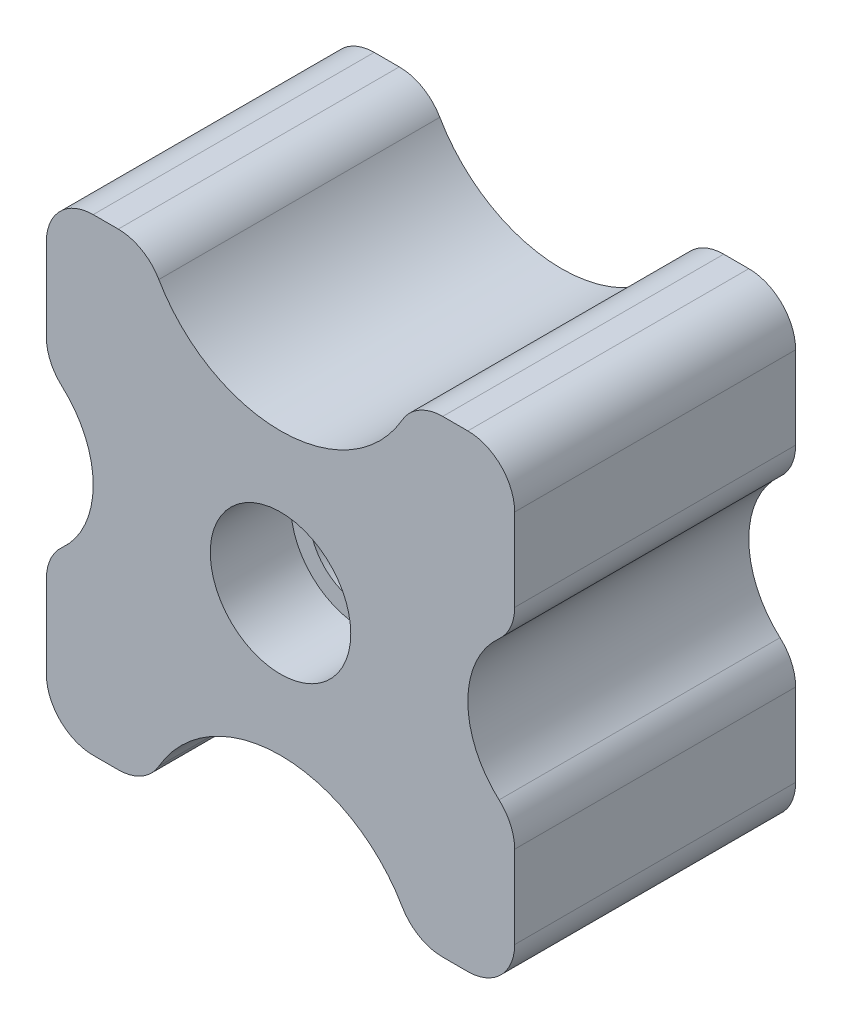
ISO-10303-21;
HEADER;
FILE_DESCRIPTION(('STEP AP214'),'2;1');
FILE_NAME('part.step','',(''),(''),'','','');
FILE_SCHEMA(('AUTOMOTIVE_DESIGN { 1 0 10303 214 1 1 1 1 }'));
ENDSEC;
DATA;
#1=APPLICATION_CONTEXT('core data for automotive mechanical design processes');
#2=APPLICATION_PROTOCOL_DEFINITION('international standard','automotive_design',2000,#1);
#3=PRODUCT_CONTEXT('',#1,'mechanical');
#4=PRODUCT('Part','Part','',(#3));
#5=PRODUCT_RELATED_PRODUCT_CATEGORY('part','',(#4));
#6=PRODUCT_DEFINITION_FORMATION('','',#4);
#7=PRODUCT_DEFINITION_CONTEXT('part definition',#1,'design');
#8=PRODUCT_DEFINITION('design','',#6,#7);
#9=PRODUCT_DEFINITION_SHAPE('','',#8);
#10=(LENGTH_UNIT() NAMED_UNIT(*) SI_UNIT(.MILLI.,.METRE.));
#11=(NAMED_UNIT(*) PLANE_ANGLE_UNIT() SI_UNIT($,.RADIAN.));
#12=(NAMED_UNIT(*) SI_UNIT($,.STERADIAN.) SOLID_ANGLE_UNIT());
#13=UNCERTAINTY_MEASURE_WITH_UNIT(LENGTH_MEASURE(1.E-05),#10,'distance_accuracy_value','');
#14=(GEOMETRIC_REPRESENTATION_CONTEXT(3) GLOBAL_UNCERTAINTY_ASSIGNED_CONTEXT((#13)) GLOBAL_UNIT_ASSIGNED_CONTEXT((#10,
#11,#12)) REPRESENTATION_CONTEXT('',''));
#15=CARTESIAN_POINT('',(0.,0.,0.));
#16=DIRECTION('',(0.,0.,1.));
#17=DIRECTION('',(1.,0.,0.));
#18=AXIS2_PLACEMENT_3D('',#15,#16,#17);
#19=CARTESIAN_POINT('',(-25.,25.,30.));
#20=DIRECTION('',(0.,-1.,0.));
#21=DIRECTION('',(0.,0.,-1.));
#22=AXIS2_PLACEMENT_3D('',#19,#20,#21);
#23=PLANE('',#22);
#24=DIRECTION('',(-1.,0.,0.));
#25=VECTOR('',#24,1.);
#26=CARTESIAN_POINT('',(-25.,25.,30.));
#27=LINE('',#26,#25);
#28=CARTESIAN_POINT('',(-17.3205080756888,25.,30.));
#29=VERTEX_POINT('',#28);
#30=CARTESIAN_POINT('',(-20.,25.,30.));
#31=VERTEX_POINT('',#30);
#32=EDGE_CURVE('E400',#29,#31,#27,.T.);
#33=ORIENTED_EDGE('',*,*,#32,.F.);
#34=DIRECTION('',(0.,0.,1.));
#35=VECTOR('',#34,1.);
#36=CARTESIAN_POINT('',(-17.3205080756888,25.,0.));
#37=LINE('',#36,#35);
#38=CARTESIAN_POINT('',(-17.3205080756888,25.,0.));
#39=VERTEX_POINT('',#38);
#40=EDGE_CURVE('E211',#29,#39,#37,.F.);
#41=ORIENTED_EDGE('',*,*,#40,.T.);
#42=DIRECTION('',(-1.,0.,0.));
#43=VECTOR('',#42,1.);
#44=CARTESIAN_POINT('',(-25.,25.,0.));
#45=LINE('',#44,#43);
#46=CARTESIAN_POINT('',(-20.,25.,0.));
#47=VERTEX_POINT('',#46);
#48=EDGE_CURVE('E326',#39,#47,#45,.T.);
#49=ORIENTED_EDGE('',*,*,#48,.T.);
#50=DIRECTION('',(0.,0.,-1.));
#51=VECTOR('',#50,1.);
#52=CARTESIAN_POINT('',(-20.,25.,30.));
#53=LINE('',#52,#51);
#54=EDGE_CURVE('E265',#47,#31,#53,.F.);
#55=ORIENTED_EDGE('',*,*,#54,.T.);
#56=EDGE_LOOP('',(#33,#41,#49,#55));
#57=FACE_BOUND('',#56,.T.);
#58=ADVANCED_FACE('F45',(#57),#23,.F.);
#59=CARTESIAN_POINT('',(20.,25.,0.));
#60=VERTEX_POINT('',#59);
#61=CARTESIAN_POINT('',(17.3205080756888,25.,0.));
#62=VERTEX_POINT('',#61);
#63=EDGE_CURVE('E330',#60,#62,#45,.T.);
#64=ORIENTED_EDGE('',*,*,#63,.T.);
#65=DIRECTION('',(0.,0.,1.));
#66=VECTOR('',#65,1.);
#67=CARTESIAN_POINT('',(17.3205080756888,25.,30.));
#68=LINE('',#67,#66);
#69=CARTESIAN_POINT('',(17.3205080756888,25.,30.));
#70=VERTEX_POINT('',#69);
#71=EDGE_CURVE('E379',#62,#70,#68,.T.);
#72=ORIENTED_EDGE('',*,*,#71,.T.);
#73=CARTESIAN_POINT('',(20.,25.,30.));
#74=VERTEX_POINT('',#73);
#75=EDGE_CURVE('E461',#74,#70,#27,.T.);
#76=ORIENTED_EDGE('',*,*,#75,.F.);
#77=DIRECTION('',(0.,0.,-1.));
#78=VECTOR('',#77,1.);
#79=CARTESIAN_POINT('',(20.,25.,30.));
#80=LINE('',#79,#78);
#81=EDGE_CURVE('E376',#74,#60,#80,.T.);
#82=ORIENTED_EDGE('',*,*,#81,.T.);
#83=EDGE_LOOP('',(#64,#72,#76,#82));
#84=FACE_BOUND('',#83,.T.);
#85=ADVANCED_FACE('F517',(#84),#23,.F.);
#86=CARTESIAN_POINT('',(25.,25.,30.));
#87=DIRECTION('',(-1.,0.,0.));
#88=DIRECTION('',(0.,-1.,0.));
#89=AXIS2_PLACEMENT_3D('',#86,#87,#88);
#90=PLANE('',#89);
#91=DIRECTION('',(0.,1.,0.));
#92=VECTOR('',#91,1.);
#93=CARTESIAN_POINT('',(25.,25.,0.));
#94=LINE('',#93,#92);
#95=CARTESIAN_POINT('',(25.,11.180339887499,0.));
#96=VERTEX_POINT('',#95);
#97=CARTESIAN_POINT('',(25.,20.,0.));
#98=VERTEX_POINT('',#97);
#99=EDGE_CURVE('E327',#96,#98,#94,.T.);
#100=ORIENTED_EDGE('',*,*,#99,.T.);
#101=DIRECTION('',(0.,0.,-1.));
#102=VECTOR('',#101,1.);
#103=CARTESIAN_POINT('',(25.,20.,30.));
#104=LINE('',#103,#102);
#105=CARTESIAN_POINT('',(25.,20.,30.));
#106=VERTEX_POINT('',#105);
#107=EDGE_CURVE('E60',#98,#106,#104,.F.);
#108=ORIENTED_EDGE('',*,*,#107,.T.);
#109=DIRECTION('',(0.,1.,0.));
#110=VECTOR('',#109,1.);
#111=CARTESIAN_POINT('',(25.,25.,30.));
#112=LINE('',#111,#110);
#113=CARTESIAN_POINT('',(25.,11.180339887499,30.));
#114=VERTEX_POINT('',#113);
#115=EDGE_CURVE('E346',#114,#106,#112,.T.);
#116=ORIENTED_EDGE('',*,*,#115,.F.);
#117=DIRECTION('',(0.,0.,1.));
#118=VECTOR('',#117,1.);
#119=CARTESIAN_POINT('',(25.,11.180339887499,0.));
#120=LINE('',#119,#118);
#121=EDGE_CURVE('E298',#114,#96,#120,.F.);
#122=ORIENTED_EDGE('',*,*,#121,.T.);
#123=EDGE_LOOP('',(#100,#108,#116,#122));
#124=FACE_BOUND('',#123,.T.);
#125=ADVANCED_FACE('F523',(#124),#90,.F.);
#126=CARTESIAN_POINT('',(25.,-20.,0.));
#127=VERTEX_POINT('',#126);
#128=CARTESIAN_POINT('',(25.,-11.180339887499,0.));
#129=VERTEX_POINT('',#128);
#130=EDGE_CURVE('E313',#127,#129,#94,.T.);
#131=ORIENTED_EDGE('',*,*,#130,.T.);
#132=DIRECTION('',(0.,0.,1.));
#133=VECTOR('',#132,1.);
#134=CARTESIAN_POINT('',(25.,-11.180339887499,30.));
#135=LINE('',#134,#133);
#136=CARTESIAN_POINT('',(25.,-11.180339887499,30.));
#137=VERTEX_POINT('',#136);
#138=EDGE_CURVE('E12',#129,#137,#135,.T.);
#139=ORIENTED_EDGE('',*,*,#138,.T.);
#140=CARTESIAN_POINT('',(25.,-20.,30.));
#141=VERTEX_POINT('',#140);
#142=EDGE_CURVE('E316',#141,#137,#112,.T.);
#143=ORIENTED_EDGE('',*,*,#142,.F.);
#144=DIRECTION('',(0.,0.,-1.));
#145=VECTOR('',#144,1.);
#146=CARTESIAN_POINT('',(25.,-20.,30.));
#147=LINE('',#146,#145);
#148=EDGE_CURVE('E53',#141,#127,#147,.T.);
#149=ORIENTED_EDGE('',*,*,#148,.T.);
#150=EDGE_LOOP('',(#131,#139,#143,#149));
#151=FACE_BOUND('',#150,.T.);
#152=ADVANCED_FACE('F312',(#151),#90,.F.);
#153=CARTESIAN_POINT('',(-25.,-25.,30.));
#154=DIRECTION('',(0.,1.,0.));
#155=DIRECTION('',(0.,0.,1.));
#156=AXIS2_PLACEMENT_3D('',#153,#154,#155);
#157=PLANE('',#156);
#158=DIRECTION('',(1.,0.,0.));
#159=VECTOR('',#158,1.);
#160=CARTESIAN_POINT('',(-25.,-25.,30.));
#161=LINE('',#160,#159);
#162=CARTESIAN_POINT('',(17.3205080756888,-25.,30.));
#163=VERTEX_POINT('',#162);
#164=CARTESIAN_POINT('',(20.,-25.,30.));
#165=VERTEX_POINT('',#164);
#166=EDGE_CURVE('E334',#163,#165,#161,.T.);
#167=ORIENTED_EDGE('',*,*,#166,.F.);
#168=DIRECTION('',(0.,0.,1.));
#169=VECTOR('',#168,1.);
#170=CARTESIAN_POINT('',(17.3205080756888,-25.,0.));
#171=LINE('',#170,#169);
#172=CARTESIAN_POINT('',(17.3205080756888,-25.,0.));
#173=VERTEX_POINT('',#172);
#174=EDGE_CURVE('E296',#163,#173,#171,.F.);
#175=ORIENTED_EDGE('',*,*,#174,.T.);
#176=DIRECTION('',(1.,0.,0.));
#177=VECTOR('',#176,1.);
#178=CARTESIAN_POINT('',(-25.,-25.,0.));
#179=LINE('',#178,#177);
#180=CARTESIAN_POINT('',(20.,-25.,0.));
#181=VERTEX_POINT('',#180);
#182=EDGE_CURVE('E341',#173,#181,#179,.T.);
#183=ORIENTED_EDGE('',*,*,#182,.T.);
#184=DIRECTION('',(0.,0.,-1.));
#185=VECTOR('',#184,1.);
#186=CARTESIAN_POINT('',(20.,-25.,30.));
#187=LINE('',#186,#185);
#188=EDGE_CURVE('E294',#181,#165,#187,.F.);
#189=ORIENTED_EDGE('',*,*,#188,.T.);
#190=EDGE_LOOP('',(#167,#175,#183,#189));
#191=FACE_BOUND('',#190,.T.);
#192=ADVANCED_FACE('F442',(#191),#157,.F.);
#193=CARTESIAN_POINT('',(-20.,-25.,30.));
#194=VERTEX_POINT('',#193);
#195=CARTESIAN_POINT('',(-17.3205080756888,-25.,30.));
#196=VERTEX_POINT('',#195);
#197=EDGE_CURVE('E350',#194,#196,#161,.T.);
#198=ORIENTED_EDGE('',*,*,#197,.F.);
#199=DIRECTION('',(0.,0.,-1.));
#200=VECTOR('',#199,1.);
#201=CARTESIAN_POINT('',(-20.,-25.,30.));
#202=LINE('',#201,#200);
#203=CARTESIAN_POINT('',(-20.,-25.,0.));
#204=VERTEX_POINT('',#203);
#205=EDGE_CURVE('E285',#194,#204,#202,.T.);
#206=ORIENTED_EDGE('',*,*,#205,.T.);
#207=CARTESIAN_POINT('',(-17.3205080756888,-25.,0.));
#208=VERTEX_POINT('',#207);
#209=EDGE_CURVE('E343',#204,#208,#179,.T.);
#210=ORIENTED_EDGE('',*,*,#209,.T.);
#211=DIRECTION('',(0.,0.,1.));
#212=VECTOR('',#211,1.);
#213=CARTESIAN_POINT('',(-17.3205080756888,-25.,30.));
#214=LINE('',#213,#212);
#215=EDGE_CURVE('E283',#208,#196,#214,.T.);
#216=ORIENTED_EDGE('',*,*,#215,.T.);
#217=EDGE_LOOP('',(#198,#206,#210,#216));
#218=FACE_BOUND('',#217,.T.);
#219=ADVANCED_FACE('F491',(#218),#157,.F.);
#220=CARTESIAN_POINT('',(-25.,25.,30.));
#221=DIRECTION('',(1.,0.,0.));
#222=DIRECTION('',(0.,0.,-1.));
#223=AXIS2_PLACEMENT_3D('',#220,#221,#222);
#224=PLANE('',#223);
#225=DIRECTION('',(0.,-1.,0.));
#226=VECTOR('',#225,1.);
#227=CARTESIAN_POINT('',(-25.,25.,30.));
#228=LINE('',#227,#226);
#229=CARTESIAN_POINT('',(-25.,-11.180339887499,30.));
#230=VERTEX_POINT('',#229);
#231=CARTESIAN_POINT('',(-25.,-20.,30.));
#232=VERTEX_POINT('',#231);
#233=EDGE_CURVE('E452',#230,#232,#228,.T.);
#234=ORIENTED_EDGE('',*,*,#233,.F.);
#235=DIRECTION('',(0.,0.,1.));
#236=VECTOR('',#235,1.);
#237=CARTESIAN_POINT('',(-25.,-11.180339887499,0.));
#238=LINE('',#237,#236);
#239=CARTESIAN_POINT('',(-25.,-11.180339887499,0.));
#240=VERTEX_POINT('',#239);
#241=EDGE_CURVE('E281',#230,#240,#238,.F.);
#242=ORIENTED_EDGE('',*,*,#241,.T.);
#243=DIRECTION('',(0.,-1.,0.));
#244=VECTOR('',#243,1.);
#245=CARTESIAN_POINT('',(-25.,25.,0.));
#246=LINE('',#245,#244);
#247=CARTESIAN_POINT('',(-25.,-20.,0.));
#248=VERTEX_POINT('',#247);
#249=EDGE_CURVE('E342',#240,#248,#246,.T.);
#250=ORIENTED_EDGE('',*,*,#249,.T.);
#251=DIRECTION('',(0.,0.,-1.));
#252=VECTOR('',#251,1.);
#253=CARTESIAN_POINT('',(-25.,-20.,30.));
#254=LINE('',#253,#252);
#255=EDGE_CURVE('E279',#248,#232,#254,.F.);
#256=ORIENTED_EDGE('',*,*,#255,.T.);
#257=EDGE_LOOP('',(#234,#242,#250,#256));
#258=FACE_BOUND('',#257,.T.);
#259=ADVANCED_FACE('F501',(#258),#224,.F.);
#260=CARTESIAN_POINT('',(-25.,20.,30.));
#261=VERTEX_POINT('',#260);
#262=CARTESIAN_POINT('',(-25.,11.180339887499,30.));
#263=VERTEX_POINT('',#262);
#264=EDGE_CURVE('E445',#261,#263,#228,.T.);
#265=ORIENTED_EDGE('',*,*,#264,.F.);
#266=DIRECTION('',(0.,0.,-1.));
#267=VECTOR('',#266,1.);
#268=CARTESIAN_POINT('',(-25.,20.,30.));
#269=LINE('',#268,#267);
#270=CARTESIAN_POINT('',(-25.,20.,0.));
#271=VERTEX_POINT('',#270);
#272=EDGE_CURVE('E270',#261,#271,#269,.T.);
#273=ORIENTED_EDGE('',*,*,#272,.T.);
#274=CARTESIAN_POINT('',(-25.,11.180339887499,0.));
#275=VERTEX_POINT('',#274);
#276=EDGE_CURVE('E337',#271,#275,#246,.T.);
#277=ORIENTED_EDGE('',*,*,#276,.T.);
#278=DIRECTION('',(0.,0.,1.));
#279=VECTOR('',#278,1.);
#280=CARTESIAN_POINT('',(-25.,11.180339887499,30.));
#281=LINE('',#280,#279);
#282=EDGE_CURVE('E268',#275,#263,#281,.T.);
#283=ORIENTED_EDGE('',*,*,#282,.T.);
#284=EDGE_LOOP('',(#265,#273,#277,#283));
#285=FACE_BOUND('',#284,.T.);
#286=ADVANCED_FACE('F638',(#285),#224,.F.);
#287=CARTESIAN_POINT('',(0.,0.,30.));
#288=DIRECTION('',(0.,0.,1.));
#289=DIRECTION('',(1.,0.,0.));
#290=AXIS2_PLACEMENT_3D('',#287,#288,#289);
#291=PLANE('',#290);
#292=CARTESIAN_POINT('',(0.,0.,30.));
#293=DIRECTION('',(0.,0.,1.));
#294=DIRECTION('',(1.,0.,0.));
#295=AXIS2_PLACEMENT_3D('',#292,#293,#294);
#296=CIRCLE('',#295,7.5);
#297=CARTESIAN_POINT('',(7.5,0.,30.));
#298=VERTEX_POINT('',#297);
#299=EDGE_CURVE('E584',#298,#298,#296,.T.);
#300=ORIENTED_EDGE('',*,*,#299,.F.);
#301=EDGE_LOOP('',(#300));
#302=FACE_BOUND('',#301,.T.);
#303=ORIENTED_EDGE('',*,*,#75,.T.);
#304=CARTESIAN_POINT('',(17.3205080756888,20.,30.));
#305=DIRECTION('',(0.,0.,1.));
#306=DIRECTION('',(1.,0.,0.));
#307=AXIS2_PLACEMENT_3D('',#304,#305,#306);
#308=CIRCLE('',#307,5.);
#309=CARTESIAN_POINT('',(12.9903810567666,22.5,30.));
#310=VERTEX_POINT('',#309);
#311=EDGE_CURVE('E216',#70,#310,#308,.T.);
#312=ORIENTED_EDGE('',*,*,#311,.T.);
#313=CARTESIAN_POINT('',(0.,30.,30.));
#314=DIRECTION('',(0.,0.,1.));
#315=DIRECTION('',(1.,0.,0.));
#316=AXIS2_PLACEMENT_3D('',#313,#314,#315);
#317=CIRCLE('',#316,15.);
#318=CARTESIAN_POINT('',(-12.9903810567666,22.5,30.));
#319=VERTEX_POINT('',#318);
#320=EDGE_CURVE('E224',#319,#310,#317,.T.);
#321=ORIENTED_EDGE('',*,*,#320,.F.);
#322=CARTESIAN_POINT('',(-17.3205080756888,20.,30.));
#323=DIRECTION('',(0.,0.,1.));
#324=DIRECTION('',(1.,0.,0.));
#325=AXIS2_PLACEMENT_3D('',#322,#323,#324);
#326=CIRCLE('',#325,5.);
#327=EDGE_CURVE('E206',#319,#29,#326,.T.);
#328=ORIENTED_EDGE('',*,*,#327,.T.);
#329=ORIENTED_EDGE('',*,*,#32,.T.);
#330=CARTESIAN_POINT('',(-20.,20.,30.));
#331=DIRECTION('',(0.,0.,1.));
#332=DIRECTION('',(1.,0.,0.));
#333=AXIS2_PLACEMENT_3D('',#330,#331,#332);
#334=CIRCLE('',#333,5.);
#335=EDGE_CURVE('E217',#31,#261,#334,.T.);
#336=ORIENTED_EDGE('',*,*,#335,.T.);
#337=ORIENTED_EDGE('',*,*,#264,.T.);
#338=CARTESIAN_POINT('',(-20.,11.180339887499,30.));
#339=DIRECTION('',(0.,0.,1.));
#340=DIRECTION('',(1.,0.,0.));
#341=AXIS2_PLACEMENT_3D('',#338,#339,#340);
#342=CIRCLE('',#341,5.);
#343=CARTESIAN_POINT('',(-23.3333333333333,7.4535599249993,30.));
#344=VERTEX_POINT('',#343);
#345=EDGE_CURVE('E469',#263,#344,#342,.T.);
#346=ORIENTED_EDGE('',*,*,#345,.T.);
#347=CARTESIAN_POINT('',(-30.,0.,30.));
#348=DIRECTION('',(0.,0.,1.));
#349=DIRECTION('',(1.,0.,0.));
#350=AXIS2_PLACEMENT_3D('',#347,#348,#349);
#351=CIRCLE('',#350,10.);
#352=CARTESIAN_POINT('',(-23.3333333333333,-7.4535599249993,30.));
#353=VERTEX_POINT('',#352);
#354=EDGE_CURVE('E332',#353,#344,#351,.T.);
#355=ORIENTED_EDGE('',*,*,#354,.F.);
#356=CARTESIAN_POINT('',(-20.,-11.180339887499,30.));
#357=DIRECTION('',(0.,0.,1.));
#358=DIRECTION('',(1.,0.,0.));
#359=AXIS2_PLACEMENT_3D('',#356,#357,#358);
#360=CIRCLE('',#359,5.);
#361=EDGE_CURVE('E472',#353,#230,#360,.T.);
#362=ORIENTED_EDGE('',*,*,#361,.T.);
#363=ORIENTED_EDGE('',*,*,#233,.T.);
#364=CARTESIAN_POINT('',(-20.,-20.,30.));
#365=DIRECTION('',(0.,0.,1.));
#366=DIRECTION('',(1.,0.,0.));
#367=AXIS2_PLACEMENT_3D('',#364,#365,#366);
#368=CIRCLE('',#367,5.);
#369=EDGE_CURVE('E475',#232,#194,#368,.T.);
#370=ORIENTED_EDGE('',*,*,#369,.T.);
#371=ORIENTED_EDGE('',*,*,#197,.T.);
#372=CARTESIAN_POINT('',(-17.3205080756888,-20.,30.));
#373=DIRECTION('',(0.,0.,1.));
#374=DIRECTION('',(1.,0.,0.));
#375=AXIS2_PLACEMENT_3D('',#372,#373,#374);
#376=CIRCLE('',#375,5.);
#377=CARTESIAN_POINT('',(-12.9903810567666,-22.5,30.));
#378=VERTEX_POINT('',#377);
#379=EDGE_CURVE('E417',#196,#378,#376,.T.);
#380=ORIENTED_EDGE('',*,*,#379,.T.);
#381=CARTESIAN_POINT('',(0.,-30.,30.));
#382=DIRECTION('',(0.,0.,1.));
#383=DIRECTION('',(1.,0.,0.));
#384=AXIS2_PLACEMENT_3D('',#381,#382,#383);
#385=CIRCLE('',#384,15.);
#386=CARTESIAN_POINT('',(12.9903810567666,-22.5,30.));
#387=VERTEX_POINT('',#386);
#388=EDGE_CURVE('E423',#387,#378,#385,.T.);
#389=ORIENTED_EDGE('',*,*,#388,.F.);
#390=CARTESIAN_POINT('',(17.3205080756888,-20.,30.));
#391=DIRECTION('',(0.,0.,1.));
#392=DIRECTION('',(1.,0.,0.));
#393=AXIS2_PLACEMENT_3D('',#390,#391,#392);
#394=CIRCLE('',#393,5.);
#395=EDGE_CURVE('E412',#387,#163,#394,.T.);
#396=ORIENTED_EDGE('',*,*,#395,.T.);
#397=ORIENTED_EDGE('',*,*,#166,.T.);
#398=CARTESIAN_POINT('',(20.,-20.,30.));
#399=DIRECTION('',(0.,0.,1.));
#400=DIRECTION('',(1.,0.,0.));
#401=AXIS2_PLACEMENT_3D('',#398,#399,#400);
#402=CIRCLE('',#401,5.);
#403=EDGE_CURVE('E381',#165,#141,#402,.T.);
#404=ORIENTED_EDGE('',*,*,#403,.T.);
#405=ORIENTED_EDGE('',*,*,#142,.T.);
#406=CARTESIAN_POINT('',(20.,-11.180339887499,30.));
#407=DIRECTION('',(0.,0.,1.));
#408=DIRECTION('',(1.,0.,0.));
#409=AXIS2_PLACEMENT_3D('',#406,#407,#408);
#410=CIRCLE('',#409,5.);
#411=CARTESIAN_POINT('',(23.3333333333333,-7.4535599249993,30.));
#412=VERTEX_POINT('',#411);
#413=EDGE_CURVE('E385',#137,#412,#410,.T.);
#414=ORIENTED_EDGE('',*,*,#413,.T.);
#415=CARTESIAN_POINT('',(30.,0.,30.));
#416=DIRECTION('',(0.,0.,1.));
#417=DIRECTION('',(1.,0.,0.));
#418=AXIS2_PLACEMENT_3D('',#415,#416,#417);
#419=CIRCLE('',#418,10.);
#420=CARTESIAN_POINT('',(23.3333333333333,7.4535599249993,30.));
#421=VERTEX_POINT('',#420);
#422=EDGE_CURVE('E236',#421,#412,#419,.T.);
#423=ORIENTED_EDGE('',*,*,#422,.F.);
#424=CARTESIAN_POINT('',(20.,11.180339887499,30.));
#425=DIRECTION('',(0.,0.,1.));
#426=DIRECTION('',(1.,0.,0.));
#427=AXIS2_PLACEMENT_3D('',#424,#425,#426);
#428=CIRCLE('',#427,5.);
#429=EDGE_CURVE('E67',#421,#114,#428,.T.);
#430=ORIENTED_EDGE('',*,*,#429,.T.);
#431=ORIENTED_EDGE('',*,*,#115,.T.);
#432=CARTESIAN_POINT('',(20.,20.,30.));
#433=DIRECTION('',(0.,0.,1.));
#434=DIRECTION('',(1.,0.,0.));
#435=AXIS2_PLACEMENT_3D('',#432,#433,#434);
#436=CIRCLE('',#435,5.);
#437=EDGE_CURVE('E408',#106,#74,#436,.T.);
#438=ORIENTED_EDGE('',*,*,#437,.T.);
#439=EDGE_LOOP('',(#303,#312,#321,#328,#329,#336,#337,#346,#355,#362,#363,#370,#371,#380,#389,
#396,#397,#404,#405,#414,#423,#430,#431,#438));
#440=FACE_BOUND('',#439,.T.);
#441=ADVANCED_FACE('F233',(#302,#440),#291,.T.);
#442=CARTESIAN_POINT('',(0.,0.,0.));
#443=DIRECTION('',(0.,0.,1.));
#444=DIRECTION('',(1.,0.,0.));
#445=AXIS2_PLACEMENT_3D('',#442,#443,#444);
#446=PLANE('',#445);
#447=CARTESIAN_POINT('',(0.,0.,0.));
#448=DIRECTION('',(0.,0.,1.));
#449=DIRECTION('',(1.,0.,0.));
#450=AXIS2_PLACEMENT_3D('',#447,#448,#449);
#451=CIRCLE('',#450,5.49999999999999);
#452=CARTESIAN_POINT('',(5.49999999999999,0.,0.));
#453=VERTEX_POINT('',#452);
#454=EDGE_CURVE('E245',#453,#453,#451,.T.);
#455=ORIENTED_EDGE('',*,*,#454,.T.);
#456=EDGE_LOOP('',(#455));
#457=FACE_BOUND('',#456,.T.);
#458=CARTESIAN_POINT('',(0.,30.,0.));
#459=DIRECTION('',(0.,0.,1.));
#460=DIRECTION('',(-1.,0.,0.));
#461=AXIS2_PLACEMENT_3D('',#458,#459,#460);
#462=CIRCLE('',#461,15.);
#463=CARTESIAN_POINT('',(-12.9903810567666,22.5,0.));
#464=VERTEX_POINT('',#463);
#465=CARTESIAN_POINT('',(12.9903810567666,22.5,0.));
#466=VERTEX_POINT('',#465);
#467=EDGE_CURVE('E227',#464,#466,#462,.T.);
#468=ORIENTED_EDGE('',*,*,#467,.T.);
#469=CARTESIAN_POINT('',(17.3205080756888,20.,0.));
#470=DIRECTION('',(0.,0.,1.));
#471=DIRECTION('',(1.,0.,0.));
#472=AXIS2_PLACEMENT_3D('',#469,#470,#471);
#473=CIRCLE('',#472,5.);
#474=EDGE_CURVE('E374',#466,#62,#473,.F.);
#475=ORIENTED_EDGE('',*,*,#474,.T.);
#476=ORIENTED_EDGE('',*,*,#63,.F.);
#477=CARTESIAN_POINT('',(20.,20.,0.));
#478=DIRECTION('',(0.,0.,1.));
#479=DIRECTION('',(1.,0.,0.));
#480=AXIS2_PLACEMENT_3D('',#477,#478,#479);
#481=CIRCLE('',#480,5.);
#482=EDGE_CURVE('E358',#60,#98,#481,.F.);
#483=ORIENTED_EDGE('',*,*,#482,.T.);
#484=ORIENTED_EDGE('',*,*,#99,.F.);
#485=CARTESIAN_POINT('',(20.,11.180339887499,0.));
#486=DIRECTION('',(0.,0.,1.));
#487=DIRECTION('',(1.,0.,0.));
#488=AXIS2_PLACEMENT_3D('',#485,#486,#487);
#489=CIRCLE('',#488,5.);
#490=CARTESIAN_POINT('',(23.3333333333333,7.4535599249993,0.));
#491=VERTEX_POINT('',#490);
#492=EDGE_CURVE('E356',#96,#491,#489,.F.);
#493=ORIENTED_EDGE('',*,*,#492,.T.);
#494=CARTESIAN_POINT('',(30.,0.,0.));
#495=DIRECTION('',(0.,0.,1.));
#496=DIRECTION('',(1.,0.,0.));
#497=AXIS2_PLACEMENT_3D('',#494,#495,#496);
#498=CIRCLE('',#497,10.);
#499=CARTESIAN_POINT('',(23.3333333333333,-7.4535599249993,0.));
#500=VERTEX_POINT('',#499);
#501=EDGE_CURVE('E229',#500,#491,#498,.F.);
#502=ORIENTED_EDGE('',*,*,#501,.F.);
#503=CARTESIAN_POINT('',(20.,-11.180339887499,0.));
#504=DIRECTION('',(0.,0.,1.));
#505=DIRECTION('',(1.,0.,0.));
#506=AXIS2_PLACEMENT_3D('',#503,#504,#505);
#507=CIRCLE('',#506,5.);
#508=EDGE_CURVE('E325',#500,#129,#507,.F.);
#509=ORIENTED_EDGE('',*,*,#508,.T.);
#510=ORIENTED_EDGE('',*,*,#130,.F.);
#511=CARTESIAN_POINT('',(20.,-20.,0.));
#512=DIRECTION('',(0.,0.,1.));
#513=DIRECTION('',(1.,0.,0.));
#514=AXIS2_PLACEMENT_3D('',#511,#512,#513);
#515=CIRCLE('',#514,5.);
#516=EDGE_CURVE('E322',#127,#181,#515,.F.);
#517=ORIENTED_EDGE('',*,*,#516,.T.);
#518=ORIENTED_EDGE('',*,*,#182,.F.);
#519=CARTESIAN_POINT('',(17.3205080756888,-20.,0.));
#520=DIRECTION('',(0.,0.,1.));
#521=DIRECTION('',(1.,0.,0.));
#522=AXIS2_PLACEMENT_3D('',#519,#520,#521);
#523=CIRCLE('',#522,5.);
#524=CARTESIAN_POINT('',(12.9903810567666,-22.5,0.));
#525=VERTEX_POINT('',#524);
#526=EDGE_CURVE('E360',#173,#525,#523,.F.);
#527=ORIENTED_EDGE('',*,*,#526,.T.);
#528=CARTESIAN_POINT('',(0.,-30.,0.));
#529=DIRECTION('',(0.,0.,1.));
#530=DIRECTION('',(1.,0.,0.));
#531=AXIS2_PLACEMENT_3D('',#528,#529,#530);
#532=CIRCLE('',#531,15.);
#533=CARTESIAN_POINT('',(-12.9903810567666,-22.5,0.));
#534=VERTEX_POINT('',#533);
#535=EDGE_CURVE('E243',#525,#534,#532,.T.);
#536=ORIENTED_EDGE('',*,*,#535,.T.);
#537=CARTESIAN_POINT('',(-17.3205080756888,-20.,0.));
#538=DIRECTION('',(0.,0.,1.));
#539=DIRECTION('',(1.,0.,0.));
#540=AXIS2_PLACEMENT_3D('',#537,#538,#539);
#541=CIRCLE('',#540,5.);
#542=EDGE_CURVE('E362',#534,#208,#541,.F.);
#543=ORIENTED_EDGE('',*,*,#542,.T.);
#544=ORIENTED_EDGE('',*,*,#209,.F.);
#545=CARTESIAN_POINT('',(-20.,-20.,0.));
#546=DIRECTION('',(0.,0.,1.));
#547=DIRECTION('',(1.,0.,0.));
#548=AXIS2_PLACEMENT_3D('',#545,#546,#547);
#549=CIRCLE('',#548,5.);
#550=EDGE_CURVE('E364',#204,#248,#549,.F.);
#551=ORIENTED_EDGE('',*,*,#550,.T.);
#552=ORIENTED_EDGE('',*,*,#249,.F.);
#553=CARTESIAN_POINT('',(-20.,-11.180339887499,0.));
#554=DIRECTION('',(0.,0.,1.));
#555=DIRECTION('',(1.,0.,0.));
#556=AXIS2_PLACEMENT_3D('',#553,#554,#555);
#557=CIRCLE('',#556,5.);
#558=CARTESIAN_POINT('',(-23.3333333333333,-7.4535599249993,0.));
#559=VERTEX_POINT('',#558);
#560=EDGE_CURVE('E366',#240,#559,#557,.F.);
#561=ORIENTED_EDGE('',*,*,#560,.T.);
#562=CARTESIAN_POINT('',(-30.,0.,0.));
#563=DIRECTION('',(0.,0.,1.));
#564=DIRECTION('',(1.,0.,0.));
#565=AXIS2_PLACEMENT_3D('',#562,#563,#564);
#566=CIRCLE('',#565,10.);
#567=CARTESIAN_POINT('',(-23.3333333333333,7.4535599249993,0.));
#568=VERTEX_POINT('',#567);
#569=EDGE_CURVE('E347',#568,#559,#566,.F.);
#570=ORIENTED_EDGE('',*,*,#569,.F.);
#571=CARTESIAN_POINT('',(-20.,11.180339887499,0.));
#572=DIRECTION('',(0.,0.,1.));
#573=DIRECTION('',(1.,0.,0.));
#574=AXIS2_PLACEMENT_3D('',#571,#572,#573);
#575=CIRCLE('',#574,5.);
#576=EDGE_CURVE('E368',#568,#275,#575,.F.);
#577=ORIENTED_EDGE('',*,*,#576,.T.);
#578=ORIENTED_EDGE('',*,*,#276,.F.);
#579=CARTESIAN_POINT('',(-20.,20.,0.));
#580=DIRECTION('',(0.,0.,1.));
#581=DIRECTION('',(1.,0.,0.));
#582=AXIS2_PLACEMENT_3D('',#579,#580,#581);
#583=CIRCLE('',#582,5.);
#584=EDGE_CURVE('E370',#271,#47,#583,.F.);
#585=ORIENTED_EDGE('',*,*,#584,.T.);
#586=ORIENTED_EDGE('',*,*,#48,.F.);
#587=CARTESIAN_POINT('',(-17.3205080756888,20.,0.));
#588=DIRECTION('',(0.,0.,1.));
#589=DIRECTION('',(1.,0.,0.));
#590=AXIS2_PLACEMENT_3D('',#587,#588,#589);
#591=CIRCLE('',#590,5.);
#592=EDGE_CURVE('E372',#39,#464,#591,.F.);
#593=ORIENTED_EDGE('',*,*,#592,.T.);
#594=EDGE_LOOP('',(#468,#475,#476,#483,#484,#493,#502,#509,#510,#517,#518,#527,#536,#543,#544,
#551,#552,#561,#570,#577,#578,#585,#586,#593));
#595=FACE_BOUND('',#594,.T.);
#596=ADVANCED_FACE('F320',(#457,#595),#446,.F.);
#597=CARTESIAN_POINT('',(-30.,0.,72.4264068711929));
#598=DIRECTION('',(0.,0.,-1.));
#599=DIRECTION('',(-1.,0.,0.));
#600=AXIS2_PLACEMENT_3D('',#597,#598,#599);
#601=CYLINDRICAL_SURFACE('',#600,10.);
#602=ORIENTED_EDGE('',*,*,#354,.T.);
#603=DIRECTION('',(0.,0.,-1.));
#604=VECTOR('',#603,1.);
#605=CARTESIAN_POINT('',(-23.3333333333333,7.4535599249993,72.4264068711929));
#606=LINE('',#605,#604);
#607=EDGE_CURVE('E276',#344,#568,#606,.T.);
#608=ORIENTED_EDGE('',*,*,#607,.T.);
#609=ORIENTED_EDGE('',*,*,#569,.T.);
#610=DIRECTION('',(0.,0.,-1.));
#611=VECTOR('',#610,1.);
#612=CARTESIAN_POINT('',(-23.3333333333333,-7.4535599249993,72.4264068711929));
#613=LINE('',#612,#611);
#614=EDGE_CURVE('E273',#559,#353,#613,.F.);
#615=ORIENTED_EDGE('',*,*,#614,.T.);
#616=EDGE_LOOP('',(#602,#608,#609,#615));
#617=FACE_BOUND('',#616,.T.);
#618=ADVANCED_FACE('F549',(#617),#601,.F.);
#619=CARTESIAN_POINT('',(0.,-30.,72.4264068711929));
#620=DIRECTION('',(0.,0.,-1.));
#621=DIRECTION('',(-1.,0.,0.));
#622=AXIS2_PLACEMENT_3D('',#619,#620,#621);
#623=CYLINDRICAL_SURFACE('',#622,15.);
#624=ORIENTED_EDGE('',*,*,#388,.T.);
#625=DIRECTION('',(0.,0.,-1.));
#626=VECTOR('',#625,1.);
#627=CARTESIAN_POINT('',(-12.9903810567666,-22.5,72.4264068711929));
#628=LINE('',#627,#626);
#629=EDGE_CURVE('E291',#378,#534,#628,.T.);
#630=ORIENTED_EDGE('',*,*,#629,.T.);
#631=ORIENTED_EDGE('',*,*,#535,.F.);
#632=DIRECTION('',(0.,0.,-1.));
#633=VECTOR('',#632,1.);
#634=CARTESIAN_POINT('',(12.9903810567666,-22.5,72.4264068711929));
#635=LINE('',#634,#633);
#636=EDGE_CURVE('E288',#525,#387,#635,.F.);
#637=ORIENTED_EDGE('',*,*,#636,.T.);
#638=EDGE_LOOP('',(#624,#630,#631,#637));
#639=FACE_BOUND('',#638,.T.);
#640=ADVANCED_FACE('F433',(#639),#623,.F.);
#641=CARTESIAN_POINT('',(30.,0.,72.4264068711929));
#642=DIRECTION('',(0.,0.,-1.));
#643=DIRECTION('',(-1.,0.,0.));
#644=AXIS2_PLACEMENT_3D('',#641,#642,#643);
#645=CYLINDRICAL_SURFACE('',#644,10.);
#646=ORIENTED_EDGE('',*,*,#501,.T.);
#647=DIRECTION('',(0.,0.,-1.));
#648=VECTOR('',#647,1.);
#649=CARTESIAN_POINT('',(23.3333333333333,7.4535599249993,72.4264068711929));
#650=LINE('',#649,#648);
#651=EDGE_CURVE('E304',#491,#421,#650,.F.);
#652=ORIENTED_EDGE('',*,*,#651,.T.);
#653=ORIENTED_EDGE('',*,*,#422,.T.);
#654=DIRECTION('',(0.,0.,-1.));
#655=VECTOR('',#654,1.);
#656=CARTESIAN_POINT('',(23.3333333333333,-7.4535599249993,72.4264068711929));
#657=LINE('',#656,#655);
#658=EDGE_CURVE('E301',#412,#500,#657,.T.);
#659=ORIENTED_EDGE('',*,*,#658,.T.);
#660=EDGE_LOOP('',(#646,#652,#653,#659));
#661=FACE_BOUND('',#660,.T.);
#662=ADVANCED_FACE('F631',(#661),#645,.F.);
#663=CARTESIAN_POINT('',(0.,30.,72.4264068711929));
#664=DIRECTION('',(0.,0.,-1.));
#665=DIRECTION('',(-1.,0.,0.));
#666=AXIS2_PLACEMENT_3D('',#663,#664,#665);
#667=CYLINDRICAL_SURFACE('',#666,15.);
#668=ORIENTED_EDGE('',*,*,#320,.T.);
#669=DIRECTION('',(0.,0.,-1.));
#670=VECTOR('',#669,1.);
#671=CARTESIAN_POINT('',(12.9903810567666,22.5,72.4264068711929));
#672=LINE('',#671,#670);
#673=EDGE_CURVE('E228',#310,#466,#672,.T.);
#674=ORIENTED_EDGE('',*,*,#673,.T.);
#675=ORIENTED_EDGE('',*,*,#467,.F.);
#676=DIRECTION('',(0.,0.,-1.));
#677=VECTOR('',#676,1.);
#678=CARTESIAN_POINT('',(-12.9903810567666,22.5,72.4264068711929));
#679=LINE('',#678,#677);
#680=EDGE_CURVE('E210',#464,#319,#679,.F.);
#681=ORIENTED_EDGE('',*,*,#680,.T.);
#682=EDGE_LOOP('',(#668,#674,#675,#681));
#683=FACE_BOUND('',#682,.T.);
#684=ADVANCED_FACE('F222',(#683),#667,.F.);
#685=CARTESIAN_POINT('',(17.3205080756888,20.,72.4264068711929));
#686=DIRECTION('',(0.,0.,-1.));
#687=DIRECTION('',(-1.,0.,0.));
#688=AXIS2_PLACEMENT_3D('',#685,#686,#687);
#689=CYLINDRICAL_SURFACE('',#688,5.);
#690=ORIENTED_EDGE('',*,*,#311,.F.);
#691=ORIENTED_EDGE('',*,*,#71,.F.);
#692=ORIENTED_EDGE('',*,*,#474,.F.);
#693=ORIENTED_EDGE('',*,*,#673,.F.);
#694=EDGE_LOOP('',(#690,#691,#692,#693));
#695=FACE_BOUND('',#694,.T.);
#696=ADVANCED_FACE('F530',(#695),#689,.T.);
#697=CARTESIAN_POINT('',(-17.3205080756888,20.,72.4264068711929));
#698=DIRECTION('',(0.,0.,-1.));
#699=DIRECTION('',(-1.,0.,0.));
#700=AXIS2_PLACEMENT_3D('',#697,#698,#699);
#701=CYLINDRICAL_SURFACE('',#700,5.);
#702=ORIENTED_EDGE('',*,*,#592,.F.);
#703=ORIENTED_EDGE('',*,*,#40,.F.);
#704=ORIENTED_EDGE('',*,*,#327,.F.);
#705=ORIENTED_EDGE('',*,*,#680,.F.);
#706=EDGE_LOOP('',(#702,#703,#704,#705));
#707=FACE_BOUND('',#706,.T.);
#708=ADVANCED_FACE('F209',(#707),#701,.T.);
#709=CARTESIAN_POINT('',(-20.,20.,30.));
#710=DIRECTION('',(0.,0.,-1.));
#711=DIRECTION('',(-1.,0.,0.));
#712=AXIS2_PLACEMENT_3D('',#709,#710,#711);
#713=CYLINDRICAL_SURFACE('',#712,5.);
#714=ORIENTED_EDGE('',*,*,#335,.F.);
#715=ORIENTED_EDGE('',*,*,#54,.F.);
#716=ORIENTED_EDGE('',*,*,#584,.F.);
#717=ORIENTED_EDGE('',*,*,#272,.F.);
#718=EDGE_LOOP('',(#714,#715,#716,#717));
#719=FACE_BOUND('',#718,.T.);
#720=ADVANCED_FACE('F536',(#719),#713,.T.);
#721=CARTESIAN_POINT('',(-20.,11.180339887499,72.4264068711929));
#722=DIRECTION('',(0.,0.,-1.));
#723=DIRECTION('',(-1.,0.,0.));
#724=AXIS2_PLACEMENT_3D('',#721,#722,#723);
#725=CYLINDRICAL_SURFACE('',#724,5.);
#726=ORIENTED_EDGE('',*,*,#345,.F.);
#727=ORIENTED_EDGE('',*,*,#282,.F.);
#728=ORIENTED_EDGE('',*,*,#576,.F.);
#729=ORIENTED_EDGE('',*,*,#607,.F.);
#730=EDGE_LOOP('',(#726,#727,#728,#729));
#731=FACE_BOUND('',#730,.T.);
#732=ADVANCED_FACE('F513',(#731),#725,.T.);
#733=CARTESIAN_POINT('',(-20.,-11.180339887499,72.4264068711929));
#734=DIRECTION('',(0.,0.,-1.));
#735=DIRECTION('',(-1.,0.,0.));
#736=AXIS2_PLACEMENT_3D('',#733,#734,#735);
#737=CYLINDRICAL_SURFACE('',#736,5.);
#738=ORIENTED_EDGE('',*,*,#560,.F.);
#739=ORIENTED_EDGE('',*,*,#241,.F.);
#740=ORIENTED_EDGE('',*,*,#361,.F.);
#741=ORIENTED_EDGE('',*,*,#614,.F.);
#742=EDGE_LOOP('',(#738,#739,#740,#741));
#743=FACE_BOUND('',#742,.T.);
#744=ADVANCED_FACE('F506',(#743),#737,.T.);
#745=CARTESIAN_POINT('',(-20.,-20.,30.));
#746=DIRECTION('',(0.,0.,-1.));
#747=DIRECTION('',(-1.,0.,0.));
#748=AXIS2_PLACEMENT_3D('',#745,#746,#747);
#749=CYLINDRICAL_SURFACE('',#748,5.);
#750=ORIENTED_EDGE('',*,*,#369,.F.);
#751=ORIENTED_EDGE('',*,*,#255,.F.);
#752=ORIENTED_EDGE('',*,*,#550,.F.);
#753=ORIENTED_EDGE('',*,*,#205,.F.);
#754=EDGE_LOOP('',(#750,#751,#752,#753));
#755=FACE_BOUND('',#754,.T.);
#756=ADVANCED_FACE('F504',(#755),#749,.T.);
#757=CARTESIAN_POINT('',(-17.3205080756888,-20.,72.4264068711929));
#758=DIRECTION('',(0.,0.,-1.));
#759=DIRECTION('',(-1.,0.,0.));
#760=AXIS2_PLACEMENT_3D('',#757,#758,#759);
#761=CYLINDRICAL_SURFACE('',#760,5.);
#762=ORIENTED_EDGE('',*,*,#379,.F.);
#763=ORIENTED_EDGE('',*,*,#215,.F.);
#764=ORIENTED_EDGE('',*,*,#542,.F.);
#765=ORIENTED_EDGE('',*,*,#629,.F.);
#766=EDGE_LOOP('',(#762,#763,#764,#765));
#767=FACE_BOUND('',#766,.T.);
#768=ADVANCED_FACE('F489',(#767),#761,.T.);
#769=CARTESIAN_POINT('',(17.3205080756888,-20.,72.4264068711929));
#770=DIRECTION('',(0.,0.,-1.));
#771=DIRECTION('',(-1.,0.,0.));
#772=AXIS2_PLACEMENT_3D('',#769,#770,#771);
#773=CYLINDRICAL_SURFACE('',#772,5.);
#774=ORIENTED_EDGE('',*,*,#526,.F.);
#775=ORIENTED_EDGE('',*,*,#174,.F.);
#776=ORIENTED_EDGE('',*,*,#395,.F.);
#777=ORIENTED_EDGE('',*,*,#636,.F.);
#778=EDGE_LOOP('',(#774,#775,#776,#777));
#779=FACE_BOUND('',#778,.T.);
#780=ADVANCED_FACE('F437',(#779),#773,.T.);
#781=CARTESIAN_POINT('',(20.,20.,30.));
#782=DIRECTION('',(0.,0.,-1.));
#783=DIRECTION('',(-1.,0.,0.));
#784=AXIS2_PLACEMENT_3D('',#781,#782,#783);
#785=CYLINDRICAL_SURFACE('',#784,5.);
#786=ORIENTED_EDGE('',*,*,#437,.F.);
#787=ORIENTED_EDGE('',*,*,#107,.F.);
#788=ORIENTED_EDGE('',*,*,#482,.F.);
#789=ORIENTED_EDGE('',*,*,#81,.F.);
#790=EDGE_LOOP('',(#786,#787,#788,#789));
#791=FACE_BOUND('',#790,.T.);
#792=ADVANCED_FACE('F741',(#791),#785,.T.);
#793=CARTESIAN_POINT('',(20.,11.180339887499,72.4264068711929));
#794=DIRECTION('',(0.,0.,-1.));
#795=DIRECTION('',(-1.,0.,0.));
#796=AXIS2_PLACEMENT_3D('',#793,#794,#795);
#797=CYLINDRICAL_SURFACE('',#796,5.);
#798=ORIENTED_EDGE('',*,*,#492,.F.);
#799=ORIENTED_EDGE('',*,*,#121,.F.);
#800=ORIENTED_EDGE('',*,*,#429,.F.);
#801=ORIENTED_EDGE('',*,*,#651,.F.);
#802=EDGE_LOOP('',(#798,#799,#800,#801));
#803=FACE_BOUND('',#802,.T.);
#804=ADVANCED_FACE('F734',(#803),#797,.T.);
#805=CARTESIAN_POINT('',(20.,-11.180339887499,72.4264068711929));
#806=DIRECTION('',(0.,0.,-1.));
#807=DIRECTION('',(-1.,0.,0.));
#808=AXIS2_PLACEMENT_3D('',#805,#806,#807);
#809=CYLINDRICAL_SURFACE('',#808,5.);
#810=ORIENTED_EDGE('',*,*,#413,.F.);
#811=ORIENTED_EDGE('',*,*,#138,.F.);
#812=ORIENTED_EDGE('',*,*,#508,.F.);
#813=ORIENTED_EDGE('',*,*,#658,.F.);
#814=EDGE_LOOP('',(#810,#811,#812,#813));
#815=FACE_BOUND('',#814,.T.);
#816=ADVANCED_FACE('F729',(#815),#809,.T.);
#817=CARTESIAN_POINT('',(20.,-20.,30.));
#818=DIRECTION('',(0.,0.,-1.));
#819=DIRECTION('',(-1.,0.,0.));
#820=AXIS2_PLACEMENT_3D('',#817,#818,#819);
#821=CYLINDRICAL_SURFACE('',#820,5.);
#822=ORIENTED_EDGE('',*,*,#403,.F.);
#823=ORIENTED_EDGE('',*,*,#188,.F.);
#824=ORIENTED_EDGE('',*,*,#516,.F.);
#825=ORIENTED_EDGE('',*,*,#148,.F.);
#826=EDGE_LOOP('',(#822,#823,#824,#825));
#827=FACE_BOUND('',#826,.T.);
#828=ADVANCED_FACE('F47',(#827),#821,.T.);
#829=CARTESIAN_POINT('',(0.,0.,30.));
#830=DIRECTION('',(0.,0.,1.));
#831=DIRECTION('',(1.,0.,0.));
#832=AXIS2_PLACEMENT_3D('',#829,#830,#831);
#833=CYLINDRICAL_SURFACE('',#832,5.5);
#834=ORIENTED_EDGE('',*,*,#454,.F.);
#835=EDGE_LOOP('',(#834));
#836=FACE_BOUND('',#835,.T.);
#837=CARTESIAN_POINT('',(0.,0.,21.4));
#838=DIRECTION('',(0.,0.,1.));
#839=DIRECTION('',(1.,0.,0.));
#840=AXIS2_PLACEMENT_3D('',#837,#838,#839);
#841=CIRCLE('',#840,5.5);
#842=CARTESIAN_POINT('',(5.5,0.,21.4));
#843=VERTEX_POINT('',#842);
#844=EDGE_CURVE('E866',#843,#843,#841,.T.);
#845=ORIENTED_EDGE('',*,*,#844,.T.);
#846=EDGE_LOOP('',(#845));
#847=FACE_BOUND('',#846,.T.);
#848=ADVANCED_FACE('F608',(#836,#847),#833,.F.);
#849=CARTESIAN_POINT('',(5.5,0.,21.4));
#850=DIRECTION('',(0.,0.,-1.));
#851=DIRECTION('',(-1.,0.,0.));
#852=AXIS2_PLACEMENT_3D('',#849,#850,#851);
#853=PLANE('',#852);
#854=ORIENTED_EDGE('',*,*,#844,.F.);
#855=EDGE_LOOP('',(#854));
#856=FACE_BOUND('',#855,.T.);
#857=CARTESIAN_POINT('',(0.,0.,21.4));
#858=DIRECTION('',(0.,0.,1.));
#859=DIRECTION('',(1.,0.,0.));
#860=AXIS2_PLACEMENT_3D('',#857,#858,#859);
#861=CIRCLE('',#860,7.5);
#862=CARTESIAN_POINT('',(7.5,0.,21.4));
#863=VERTEX_POINT('',#862);
#864=EDGE_CURVE('E587',#863,#863,#861,.T.);
#865=ORIENTED_EDGE('',*,*,#864,.T.);
#866=EDGE_LOOP('',(#865));
#867=FACE_BOUND('',#866,.T.);
#868=ADVANCED_FACE('F603',(#856,#867),#853,.F.);
#869=CARTESIAN_POINT('',(0.,0.,30.));
#870=DIRECTION('',(0.,0.,1.));
#871=DIRECTION('',(1.,0.,0.));
#872=AXIS2_PLACEMENT_3D('',#869,#870,#871);
#873=CYLINDRICAL_SURFACE('',#872,7.5);
#874=ORIENTED_EDGE('',*,*,#864,.F.);
#875=EDGE_LOOP('',(#874));
#876=FACE_BOUND('',#875,.T.);
#877=ORIENTED_EDGE('',*,*,#299,.T.);
#878=EDGE_LOOP('',(#877));
#879=FACE_BOUND('',#878,.T.);
#880=ADVANCED_FACE('F607',(#876,#879),#873,.F.);
#881=CLOSED_SHELL('',(#58,#85,#125,#152,#192,#219,#259,#286,#441,#596,#618,#640,#662,#684,#696,
#708,#720,#732,#744,#756,#768,#780,#792,#804,#816,#828,#848,#868,#880));
#882=MANIFOLD_SOLID_BREP('B2',#881);
#883=ADVANCED_BREP_SHAPE_REPRESENTATION('',(#18,#882),#14);
#884=SHAPE_DEFINITION_REPRESENTATION(#9,#883);
ENDSEC;
END-ISO-10303-21;
